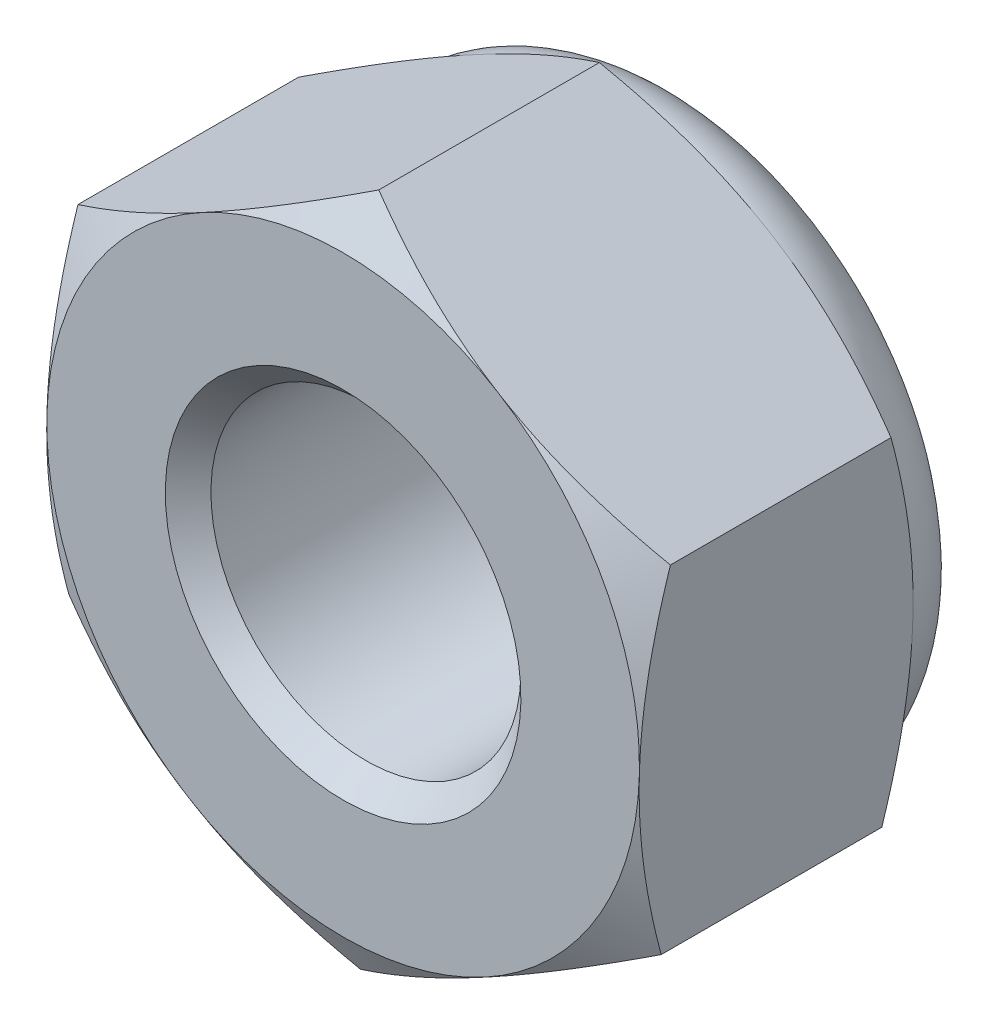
ISO-10303-21;
HEADER;
FILE_DESCRIPTION(('STEP AP214'),'2;1');
FILE_NAME('part.step','',(''),(''),'','','');
FILE_SCHEMA(('AUTOMOTIVE_DESIGN { 1 0 10303 214 1 1 1 1 }'));
ENDSEC;
DATA;
#1=APPLICATION_CONTEXT('core data for automotive mechanical design processes');
#2=APPLICATION_PROTOCOL_DEFINITION('international standard','automotive_design',2000,#1);
#3=PRODUCT_CONTEXT('',#1,'mechanical');
#4=PRODUCT('Part','Part','',(#3));
#5=PRODUCT_RELATED_PRODUCT_CATEGORY('part','',(#4));
#6=PRODUCT_DEFINITION_FORMATION('','',#4);
#7=PRODUCT_DEFINITION_CONTEXT('part definition',#1,'design');
#8=PRODUCT_DEFINITION('design','',#6,#7);
#9=PRODUCT_DEFINITION_SHAPE('','',#8);
#10=(LENGTH_UNIT() NAMED_UNIT(*) SI_UNIT(.MILLI.,.METRE.));
#11=(NAMED_UNIT(*) PLANE_ANGLE_UNIT() SI_UNIT($,.RADIAN.));
#12=(NAMED_UNIT(*) SI_UNIT($,.STERADIAN.) SOLID_ANGLE_UNIT());
#13=UNCERTAINTY_MEASURE_WITH_UNIT(LENGTH_MEASURE(1.E-05),#10,'distance_accuracy_value','');
#14=(GEOMETRIC_REPRESENTATION_CONTEXT(3) GLOBAL_UNCERTAINTY_ASSIGNED_CONTEXT((#13)) GLOBAL_UNIT_ASSIGNED_CONTEXT((#10,
#11,#12)) REPRESENTATION_CONTEXT('',''));
#15=CARTESIAN_POINT('',(0.,0.,0.));
#16=DIRECTION('',(0.,0.,1.));
#17=DIRECTION('',(1.,0.,0.));
#18=AXIS2_PLACEMENT_3D('',#15,#16,#17);
#19=CARTESIAN_POINT('',(826.812757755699,161.353696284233,22.9999999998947));
#20=DIRECTION('',(-0.47652069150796,0.879163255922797,0.));
#21=DIRECTION('',(-0.879163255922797,-0.47652069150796,0.));
#22=AXIS2_PLACEMENT_3D('',#19,#20,#21);
#23=PLANE('',#22);
#24=DIRECTION('',(0.,0.,1.));
#25=VECTOR('',#24,1.);
#26=CARTESIAN_POINT('',(820.214150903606,157.777144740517,22.9999999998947));
#27=LINE('',#26,#25);
#28=CARTESIAN_POINT('',(820.214150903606,157.777144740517,23.5805565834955));
#29=VERTEX_POINT('',#28);
#30=CARTESIAN_POINT('',(820.214150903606,157.777144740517,28.419443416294));
#31=VERTEX_POINT('',#30);
#32=EDGE_CURVE('E175',#29,#31,#27,.T.);
#33=ORIENTED_EDGE('',*,*,#32,.T.);
#34=CARTESIAN_POINT('',(820.213947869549,157.777034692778,28.4193767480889));
#35=CARTESIAN_POINT('',(820.358992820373,157.855651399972,28.4669955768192));
#36=CARTESIAN_POINT('',(820.504578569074,157.934561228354,28.512453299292));
#37=CARTESIAN_POINT('',(820.796932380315,158.093021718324,28.5984513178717));
#38=CARTESIAN_POINT('',(820.943700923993,158.172572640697,28.6389894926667));
#39=CARTESIAN_POINT('',(821.386356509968,158.412499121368,28.7524289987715));
#40=CARTESIAN_POINT('',(821.683990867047,158.573821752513,28.8169521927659));
#41=CARTESIAN_POINT('',(822.12939526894,158.815238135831,28.8926134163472));
#42=CARTESIAN_POINT('',(822.275834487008,158.894610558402,28.9141671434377));
#43=CARTESIAN_POINT('',(822.56937460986,159.053714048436,28.9503096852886));
#44=CARTESIAN_POINT('',(822.716475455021,159.133445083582,28.964899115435));
#45=CARTESIAN_POINT('',(823.010932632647,159.293045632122,28.9867412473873));
#46=CARTESIAN_POINT('',(823.158288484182,159.372914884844,28.9940022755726));
#47=CARTESIAN_POINT('',(823.453128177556,159.532722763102,29.0010396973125));
#48=CARTESIAN_POINT('',(823.6006120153,159.612661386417,29.0008163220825));
#49=CARTESIAN_POINT('',(824.004670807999,159.83166778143,28.9899165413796));
#50=CARTESIAN_POINT('',(824.261113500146,159.970663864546,28.9716181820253));
#51=CARTESIAN_POINT('',(824.772295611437,160.24773282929,28.913593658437));
#52=CARTESIAN_POINT('',(825.027033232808,160.385804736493,28.8738476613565));
#53=CARTESIAN_POINT('',(825.539244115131,160.663431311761,28.7744940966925));
#54=CARTESIAN_POINT('',(825.796652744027,160.802950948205,28.7144655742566));
#55=CARTESIAN_POINT('',(826.307631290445,161.079909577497,28.5782250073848));
#56=CARTESIAN_POINT('',(826.56120775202,161.217352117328,28.5020449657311));
#57=CARTESIAN_POINT('',(826.812960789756,161.353806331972,28.4193767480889));
#58=B_SPLINE_CURVE_WITH_KNOTS('',3,(#34,#35,#36,#37,#38,#39,#40,#41,#42,#43,#44,#45,#46,#47,#48,
#49,#50,#51,#52,#53,#54,#55,#56,#57),.UNSPECIFIED.,.F.,.F.,(4,2,2,2,2,2,2,2,2,2,2,4),(0.,
0.515105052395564,1.03043143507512,2.06322554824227,2.56697389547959,3.07067772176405,
3.57380860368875,4.07692394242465,4.95279354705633,5.82947446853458,6.72559912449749,
7.6199645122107),.UNSPECIFIED.);
#59=CARTESIAN_POINT('',(823.513454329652,159.565420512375,28.9999999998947));
#60=VERTEX_POINT('',#59);
#61=EDGE_CURVE('E39',#31,#60,#58,.T.);
#62=ORIENTED_EDGE('',*,*,#61,.T.);
#63=CARTESIAN_POINT('',(826.812757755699,161.353696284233,28.419443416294));
#64=VERTEX_POINT('',#63);
#65=EDGE_CURVE('E273',#60,#64,#58,.T.);
#66=ORIENTED_EDGE('',*,*,#65,.T.);
#67=DIRECTION('',(0.,0.,1.));
#68=VECTOR('',#67,1.);
#69=CARTESIAN_POINT('',(826.812757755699,161.353696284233,22.9999999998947));
#70=LINE('',#69,#68);
#71=CARTESIAN_POINT('',(826.812757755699,161.353696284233,23.5805565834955));
#72=VERTEX_POINT('',#71);
#73=EDGE_CURVE('E149',#72,#64,#70,.T.);
#74=ORIENTED_EDGE('',*,*,#73,.F.);
#75=CARTESIAN_POINT('',(820.213947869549,157.777034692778,23.5806232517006));
#76=CARTESIAN_POINT('',(820.358992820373,157.855651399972,23.5330044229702));
#77=CARTESIAN_POINT('',(820.504578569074,157.934561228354,23.4875467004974));
#78=CARTESIAN_POINT('',(820.796932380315,158.093021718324,23.4015486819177));
#79=CARTESIAN_POINT('',(820.943700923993,158.172572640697,23.3610105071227));
#80=CARTESIAN_POINT('',(821.386356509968,158.412499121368,23.2475710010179));
#81=CARTESIAN_POINT('',(821.683990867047,158.573821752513,23.1830478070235));
#82=CARTESIAN_POINT('',(822.12939526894,158.815238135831,23.1073865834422));
#83=CARTESIAN_POINT('',(822.275834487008,158.894610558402,23.0858328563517));
#84=CARTESIAN_POINT('',(822.56937460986,159.053714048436,23.0496903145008));
#85=CARTESIAN_POINT('',(822.716475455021,159.133445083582,23.0351008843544));
#86=CARTESIAN_POINT('',(823.010932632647,159.293045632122,23.0132587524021));
#87=CARTESIAN_POINT('',(823.158288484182,159.372914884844,23.0059977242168));
#88=CARTESIAN_POINT('',(823.453128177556,159.532722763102,22.9989603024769));
#89=CARTESIAN_POINT('',(823.6006120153,159.612661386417,22.9991836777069));
#90=CARTESIAN_POINT('',(824.004670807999,159.83166778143,23.0100834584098));
#91=CARTESIAN_POINT('',(824.261113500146,159.970663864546,23.0283818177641));
#92=CARTESIAN_POINT('',(824.772295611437,160.24773282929,23.0864063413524));
#93=CARTESIAN_POINT('',(825.027033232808,160.385804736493,23.1261523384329));
#94=CARTESIAN_POINT('',(825.539244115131,160.663431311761,23.2255059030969));
#95=CARTESIAN_POINT('',(825.796652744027,160.802950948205,23.2855344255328));
#96=CARTESIAN_POINT('',(826.307631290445,161.079909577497,23.4217749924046));
#97=CARTESIAN_POINT('',(826.56120775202,161.217352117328,23.4979550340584));
#98=CARTESIAN_POINT('',(826.812960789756,161.353806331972,23.5806232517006));
#99=B_SPLINE_CURVE_WITH_KNOTS('',3,(#75,#76,#77,#78,#79,#80,#81,#82,#83,#84,#85,#86,#87,#88,#89,
#90,#91,#92,#93,#94,#95,#96,#97,#98),.UNSPECIFIED.,.F.,.F.,(4,2,2,2,2,2,2,2,2,2,2,4),(0.,
0.515105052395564,1.03043143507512,2.06322554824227,2.56697389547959,3.07067772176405,
3.57380860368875,4.07692394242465,4.95279354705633,5.82947446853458,6.72559912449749,
7.61996451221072),.UNSPECIFIED.);
#100=CARTESIAN_POINT('',(823.513454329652,159.565420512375,22.9999999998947));
#101=VERTEX_POINT('',#100);
#102=EDGE_CURVE('E177',#101,#72,#99,.T.);
#103=ORIENTED_EDGE('',*,*,#102,.F.);
#104=EDGE_CURVE('E182',#29,#101,#99,.T.);
#105=ORIENTED_EDGE('',*,*,#104,.F.);
#106=EDGE_LOOP('',(#33,#62,#66,#74,#103,#105));
#107=FACE_BOUND('',#106,.T.);
#108=ADVANCED_FACE('F16',(#107),#23,.T.);
#109=CARTESIAN_POINT('',(833.209445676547,157.427410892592,22.9999999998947));
#110=DIRECTION('',(0.523117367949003,0.85226065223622,0.));
#111=DIRECTION('',(-0.85226065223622,0.523117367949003,0.));
#112=AXIS2_PLACEMENT_3D('',#109,#110,#111);
#113=PLANE('',#112);
#114=ORIENTED_EDGE('',*,*,#73,.T.);
#115=CARTESIAN_POINT('',(826.812560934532,161.353817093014,28.4193767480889));
#116=CARTESIAN_POINT('',(826.953167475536,161.267512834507,28.4669955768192));
#117=CARTESIAN_POINT('',(827.094298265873,161.180886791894,28.512453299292));
#118=CARTESIAN_POINT('',(827.377705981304,161.006931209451,28.5984513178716));
#119=CARTESIAN_POINT('',(827.519983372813,160.919601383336,28.6389894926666));
#120=CARTESIAN_POINT('',(827.949093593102,160.65621364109,28.7524289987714));
#121=CARTESIAN_POINT('',(828.237620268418,160.479116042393,28.8169521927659));
#122=CARTESIAN_POINT('',(828.669395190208,160.214092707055,28.8926134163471));
#123=CARTESIAN_POINT('',(828.811353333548,160.126958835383,28.9141671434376));
#124=CARTESIAN_POINT('',(829.095911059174,159.95229737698,28.9503096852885));
#125=CARTESIAN_POINT('',(829.238510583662,159.864769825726,28.9648991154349));
#126=CARTESIAN_POINT('',(829.523957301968,159.689562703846,28.9867412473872));
#127=CARTESIAN_POINT('',(829.666804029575,159.601883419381,28.9940022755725));
#128=CARTESIAN_POINT('',(829.952621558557,159.426448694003,29.0010396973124));
#129=CARTESIAN_POINT('',(830.095592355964,159.338693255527,29.0008163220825));
#130=CARTESIAN_POINT('',(830.487286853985,159.098271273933,28.9899165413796));
#131=CARTESIAN_POINT('',(830.735882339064,158.945683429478,28.9716181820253));
#132=CARTESIAN_POINT('',(831.231422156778,158.641521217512,28.9135936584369));
#133=CARTESIAN_POINT('',(831.47836474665,158.489947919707,28.8738476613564));
#134=CARTESIAN_POINT('',(831.974901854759,158.185173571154,28.7744940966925));
#135=CARTESIAN_POINT('',(832.224433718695,158.032010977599,28.7144655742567));
#136=CARTESIAN_POINT('',(832.719776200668,157.727969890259,28.5782250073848));
#137=CARTESIAN_POINT('',(832.965593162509,157.577087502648,28.5020449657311));
#138=CARTESIAN_POINT('',(833.209642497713,157.427290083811,28.4193767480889));
#139=B_SPLINE_CURVE_WITH_KNOTS('',3,(#115,#116,#117,#118,#119,#120,#121,#122,#123,#124,#125,
#126,#127,#128,#129,#130,#131,#132,#133,#134,#135,#136,#137,#138),.UNSPECIFIED.,.F.,.F.,(4,2,2,
2,2,2,2,2,2,2,2,4),(0.,0.51510505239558,1.03043143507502,2.06322554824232,2.56697389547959,
3.07067772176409,3.57380860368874,4.07692394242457,4.95279354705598,5.82947446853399,
6.72559912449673,7.61996451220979),.UNSPECIFIED.);
#140=CARTESIAN_POINT('',(830.011101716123,159.390553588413,28.9999999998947));
#141=VERTEX_POINT('',#140);
#142=EDGE_CURVE('E279',#64,#141,#139,.T.);
#143=ORIENTED_EDGE('',*,*,#142,.T.);
#144=CARTESIAN_POINT('',(833.209445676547,157.427410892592,28.419443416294));
#145=VERTEX_POINT('',#144);
#146=EDGE_CURVE('E274',#141,#145,#139,.T.);
#147=ORIENTED_EDGE('',*,*,#146,.T.);
#148=DIRECTION('',(0.,0.,1.));
#149=VECTOR('',#148,1.);
#150=CARTESIAN_POINT('',(833.209445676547,157.427410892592,22.9999999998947));
#151=LINE('',#150,#149);
#152=CARTESIAN_POINT('',(833.209445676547,157.427410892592,23.5805565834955));
#153=VERTEX_POINT('',#152);
#154=EDGE_CURVE('E153',#153,#145,#151,.T.);
#155=ORIENTED_EDGE('',*,*,#154,.F.);
#156=CARTESIAN_POINT('',(826.812560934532,161.353817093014,23.5806232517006));
#157=CARTESIAN_POINT('',(826.953167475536,161.267512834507,23.5330044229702));
#158=CARTESIAN_POINT('',(827.094298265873,161.180886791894,23.4875467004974));
#159=CARTESIAN_POINT('',(827.377705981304,161.006931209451,23.4015486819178));
#160=CARTESIAN_POINT('',(827.519983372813,160.919601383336,23.3610105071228));
#161=CARTESIAN_POINT('',(827.949093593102,160.65621364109,23.247571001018));
#162=CARTESIAN_POINT('',(828.237620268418,160.479116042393,23.1830478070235));
#163=CARTESIAN_POINT('',(828.669395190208,160.214092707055,23.1073865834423));
#164=CARTESIAN_POINT('',(828.811353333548,160.126958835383,23.0858328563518));
#165=CARTESIAN_POINT('',(829.095911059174,159.95229737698,23.0496903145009));
#166=CARTESIAN_POINT('',(829.238510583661,159.864769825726,23.0351008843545));
#167=CARTESIAN_POINT('',(829.523957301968,159.689562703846,23.0132587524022));
#168=CARTESIAN_POINT('',(829.666804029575,159.601883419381,23.0059977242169));
#169=CARTESIAN_POINT('',(829.952621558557,159.426448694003,22.998960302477));
#170=CARTESIAN_POINT('',(830.095592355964,159.338693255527,22.9991836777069));
#171=CARTESIAN_POINT('',(830.487286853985,159.098271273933,23.0100834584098));
#172=CARTESIAN_POINT('',(830.735882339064,158.945683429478,23.0283818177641));
#173=CARTESIAN_POINT('',(831.231422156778,158.641521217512,23.0864063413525));
#174=CARTESIAN_POINT('',(831.47836474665,158.489947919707,23.126152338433));
#175=CARTESIAN_POINT('',(831.974901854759,158.185173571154,23.2255059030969));
#176=CARTESIAN_POINT('',(832.224433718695,158.032010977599,23.2855344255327));
#177=CARTESIAN_POINT('',(832.719776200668,157.727969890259,23.4217749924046));
#178=CARTESIAN_POINT('',(832.965593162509,157.577087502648,23.4979550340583));
#179=CARTESIAN_POINT('',(833.209642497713,157.427290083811,23.5806232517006));
#180=B_SPLINE_CURVE_WITH_KNOTS('',3,(#156,#157,#158,#159,#160,#161,#162,#163,#164,#165,#166,
#167,#168,#169,#170,#171,#172,#173,#174,#175,#176,#177,#178,#179),.UNSPECIFIED.,.F.,.F.,(4,2,2,
2,2,2,2,2,2,2,2,4),(0.,0.515105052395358,1.03043143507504,2.06322554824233,2.56697389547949,
3.07067772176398,3.57380860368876,4.07692394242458,4.95279354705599,5.82947446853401,
6.72559912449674,7.61996451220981),.UNSPECIFIED.);
#181=CARTESIAN_POINT('',(830.011101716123,159.390553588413,22.9999999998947));
#182=VERTEX_POINT('',#181);
#183=EDGE_CURVE('E163',#182,#153,#180,.T.);
#184=ORIENTED_EDGE('',*,*,#183,.F.);
#185=EDGE_CURVE('E181',#72,#182,#180,.T.);
#186=ORIENTED_EDGE('',*,*,#185,.F.);
#187=EDGE_LOOP('',(#114,#143,#147,#155,#184,#186));
#188=FACE_BOUND('',#187,.T.);
#189=ADVANCED_FACE('F280',(#188),#113,.T.);
#190=CARTESIAN_POINT('',(833.209445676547,157.427410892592,22.9999999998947));
#191=DIRECTION('',(-0.999638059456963,0.0269026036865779,0.));
#192=DIRECTION('',(0.,0.,1.));
#193=AXIS2_PLACEMENT_3D('',#190,#191,#192);
#194=PLANE('',#193);
#195=CARTESIAN_POINT('',(832.840726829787,143.726677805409,25.8895764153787));
#196=CARTESIAN_POINT('',(832.848404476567,144.011961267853,26.027491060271));
#197=CARTESIAN_POINT('',(832.856100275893,144.297919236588,26.1640347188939));
#198=CARTESIAN_POINT('',(832.871537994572,144.871548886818,26.4335966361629));
#199=CARTESIAN_POINT('',(832.879279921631,145.159220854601,26.5666142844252));
#200=CARTESIAN_POINT('',(832.894861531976,145.738197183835,26.8290414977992));
#201=CARTESIAN_POINT('',(832.90270152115,146.029512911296,26.9584260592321));
#202=CARTESIAN_POINT('',(832.918445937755,146.614538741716,27.2116377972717));
#203=CARTESIAN_POINT('',(832.926350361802,146.908248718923,27.3354652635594));
#204=CARTESIAN_POINT('',(832.942334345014,147.502176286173,27.5775551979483));
#205=CARTESIAN_POINT('',(832.950414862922,147.802429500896,27.6957306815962));
#206=CARTESIAN_POINT('',(832.96667121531,148.40647767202,27.9228261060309));
#207=CARTESIAN_POINT('',(832.97484706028,148.7102730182,28.0317450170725));
#208=CARTESIAN_POINT('',(832.991290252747,149.321263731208,28.2374009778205));
#209=CARTESIAN_POINT('',(832.999557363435,149.628450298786,28.3341639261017));
#210=CARTESIAN_POINT('',(833.016209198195,150.247193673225,28.5123642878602));
#211=CARTESIAN_POINT('',(833.024593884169,150.558749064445,28.5938065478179));
#212=CARTESIAN_POINT('',(833.041486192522,151.186427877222,28.7374159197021));
#213=CARTESIAN_POINT('',(833.049993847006,151.502552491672,28.799577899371));
#214=CARTESIAN_POINT('',(833.067112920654,152.138657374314,28.9004257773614));
#215=CARTESIAN_POINT('',(833.07572433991,152.458637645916,28.939111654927));
#216=CARTESIAN_POINT('',(833.08865517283,152.939117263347,28.9770534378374));
#217=CARTESIAN_POINT('',(833.092954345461,153.098864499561,28.9863547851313));
#218=CARTESIAN_POINT('',(833.101559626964,153.418616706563,28.9981859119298));
#219=CARTESIAN_POINT('',(833.105865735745,153.578621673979,29.0007157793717));
#220=CARTESIAN_POINT('',(833.114475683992,153.898547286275,28.9989359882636));
#221=CARTESIAN_POINT('',(833.118779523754,154.058467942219,28.9946282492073));
#222=CARTESIAN_POINT('',(833.127378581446,154.377988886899,28.9792824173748));
#223=CARTESIAN_POINT('',(833.131673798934,154.537589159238,28.9682439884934));
#224=CARTESIAN_POINT('',(833.142084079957,154.924410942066,28.9335631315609));
#225=CARTESIAN_POINT('',(833.148191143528,155.1513351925,28.9065481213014));
#226=CARTESIAN_POINT('',(833.160358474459,155.603444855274,28.8404101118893));
#227=CARTESIAN_POINT('',(833.166418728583,155.828629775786,28.801283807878));
#228=CARTESIAN_POINT('',(833.17848743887,156.277074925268,28.7123108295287));
#229=CARTESIAN_POINT('',(833.184495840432,156.500333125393,28.662454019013));
#230=CARTESIAN_POINT('',(833.196450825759,156.944552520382,28.5535412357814));
#231=CARTESIAN_POINT('',(833.202397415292,157.165513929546,28.4944861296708));
#232=CARTESIAN_POINT('',(833.214375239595,157.610581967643,28.3670458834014));
#233=CARTESIAN_POINT('',(833.220404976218,157.83463292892,28.2984675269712));
#234=CARTESIAN_POINT('',(833.232400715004,158.280366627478,28.1545348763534));
#235=CARTESIAN_POINT('',(833.238366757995,158.502050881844,28.0791852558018));
#236=CARTESIAN_POINT('',(833.250211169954,158.942161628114,27.9232664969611));
#237=CARTESIAN_POINT('',(833.256089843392,159.160599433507,27.8427291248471));
#238=CARTESIAN_POINT('',(833.267801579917,159.595780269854,27.6769272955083));
#239=CARTESIAN_POINT('',(833.273634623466,159.812522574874,27.591660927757));
#240=CARTESIAN_POINT('',(833.279446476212,160.028477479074,27.5044978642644));
#241=B_SPLINE_CURVE_WITH_KNOTS('',3,(#195,#196,#197,#198,#199,#200,#201,#202,#203,#204,#205,
#206,#207,#208,#209,#210,#211,#212,#213,#214,#215,#216,#217,#218,#219,#220,#221,#222,#223,#224,
#225,#226,#227,#228,#229,#230,#231,#232,#233,#234,#235,#236,#237,#238,#239,#240),.UNSPECIFIED.,
.F.,.F.,(4,2,2,2,2,2,2,2,2,2,2,2,2,2,2,2,2,2,2,2,2,2,4),(0.,0.9509041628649,1.9019718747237,
2.8584821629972,3.81494253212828,4.78314526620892,5.75145556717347,6.71766655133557,
7.68357137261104,8.64973308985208,9.61589566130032,10.0960003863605,10.5760988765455,
11.056062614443,11.5360503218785,12.221493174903,12.9071232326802,13.5934038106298,
14.2796197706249,14.9826563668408,15.6852113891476,16.3838119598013,17.0826968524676),.UNSPECIFIED.);
#242=CARTESIAN_POINT('',(833.007526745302,149.924573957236,28.419443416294));
#243=VERTEX_POINT('',#242);
#244=CARTESIAN_POINT('',(833.108486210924,153.675992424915,28.9999999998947));
#245=VERTEX_POINT('',#244);
#246=EDGE_CURVE('E263',#243,#245,#241,.T.);
#247=ORIENTED_EDGE('',*,*,#246,.F.);
#248=DIRECTION('',(0.,0.,1.));
#249=VECTOR('',#248,1.);
#250=CARTESIAN_POINT('',(833.007526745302,149.924573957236,22.9999999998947));
#251=LINE('',#250,#249);
#252=CARTESIAN_POINT('',(833.007526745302,149.924573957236,23.5805565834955));
#253=VERTEX_POINT('',#252);
#254=EDGE_CURVE('E160',#253,#243,#251,.T.);
#255=ORIENTED_EDGE('',*,*,#254,.F.);
#256=CARTESIAN_POINT('',(832.840726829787,143.726677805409,26.1104235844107));
#257=CARTESIAN_POINT('',(832.848404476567,144.011961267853,25.9725089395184));
#258=CARTESIAN_POINT('',(832.856100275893,144.297919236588,25.8359652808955));
#259=CARTESIAN_POINT('',(832.871537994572,144.871548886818,25.5664033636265));
#260=CARTESIAN_POINT('',(832.879279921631,145.159220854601,25.4333857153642));
#261=CARTESIAN_POINT('',(832.894861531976,145.738197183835,25.1709585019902));
#262=CARTESIAN_POINT('',(832.90270152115,146.029512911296,25.0415739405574));
#263=CARTESIAN_POINT('',(832.918445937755,146.614538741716,24.7883622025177));
#264=CARTESIAN_POINT('',(832.926350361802,146.908248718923,24.6645347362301));
#265=CARTESIAN_POINT('',(832.942334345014,147.502176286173,24.4224448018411));
#266=CARTESIAN_POINT('',(832.950414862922,147.802429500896,24.3042693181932));
#267=CARTESIAN_POINT('',(832.96667121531,148.40647767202,24.0771738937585));
#268=CARTESIAN_POINT('',(832.97484706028,148.7102730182,23.9682549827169));
#269=CARTESIAN_POINT('',(832.991290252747,149.321263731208,23.7625990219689));
#270=CARTESIAN_POINT('',(832.999557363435,149.628450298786,23.6658360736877));
#271=CARTESIAN_POINT('',(833.016209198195,150.247193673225,23.4876357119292));
#272=CARTESIAN_POINT('',(833.024593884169,150.558749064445,23.4061934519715));
#273=CARTESIAN_POINT('',(833.041486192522,151.186427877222,23.2625840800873));
#274=CARTESIAN_POINT('',(833.049993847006,151.502552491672,23.2004221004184));
#275=CARTESIAN_POINT('',(833.067112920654,152.138657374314,23.099574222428));
#276=CARTESIAN_POINT('',(833.07572433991,152.458637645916,23.0608883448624));
#277=CARTESIAN_POINT('',(833.08865517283,152.939117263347,23.022946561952));
#278=CARTESIAN_POINT('',(833.092954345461,153.098864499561,23.0136452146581));
#279=CARTESIAN_POINT('',(833.101559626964,153.418616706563,23.0018140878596));
#280=CARTESIAN_POINT('',(833.105865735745,153.578621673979,22.9992842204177));
#281=CARTESIAN_POINT('',(833.114475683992,153.898547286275,23.0010640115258));
#282=CARTESIAN_POINT('',(833.118779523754,154.058467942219,23.0053717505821));
#283=CARTESIAN_POINT('',(833.127378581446,154.377988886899,23.0207175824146));
#284=CARTESIAN_POINT('',(833.131673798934,154.537589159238,23.031756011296));
#285=CARTESIAN_POINT('',(833.142084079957,154.924410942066,23.0664368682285));
#286=CARTESIAN_POINT('',(833.148191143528,155.1513351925,23.0934518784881));
#287=CARTESIAN_POINT('',(833.160358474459,155.603444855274,23.1595898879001));
#288=CARTESIAN_POINT('',(833.166418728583,155.828629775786,23.1987161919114));
#289=CARTESIAN_POINT('',(833.17848743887,156.277074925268,23.2876891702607));
#290=CARTESIAN_POINT('',(833.184495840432,156.500333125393,23.3375459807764));
#291=CARTESIAN_POINT('',(833.196450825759,156.944552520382,23.446458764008));
#292=CARTESIAN_POINT('',(833.202397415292,157.165513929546,23.5055138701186));
#293=CARTESIAN_POINT('',(833.214375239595,157.610581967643,23.632954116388));
#294=CARTESIAN_POINT('',(833.220404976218,157.83463292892,23.7015324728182));
#295=CARTESIAN_POINT('',(833.232400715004,158.280366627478,23.845465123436));
#296=CARTESIAN_POINT('',(833.238366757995,158.502050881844,23.9208147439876));
#297=CARTESIAN_POINT('',(833.250211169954,158.942161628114,24.0767335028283));
#298=CARTESIAN_POINT('',(833.256089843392,159.160599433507,24.1572708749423));
#299=CARTESIAN_POINT('',(833.267801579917,159.595780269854,24.3230727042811));
#300=CARTESIAN_POINT('',(833.273634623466,159.812522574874,24.4083390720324));
#301=CARTESIAN_POINT('',(833.279446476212,160.028477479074,24.495502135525));
#302=B_SPLINE_CURVE_WITH_KNOTS('',3,(#256,#257,#258,#259,#260,#261,#262,#263,#264,#265,#266,
#267,#268,#269,#270,#271,#272,#273,#274,#275,#276,#277,#278,#279,#280,#281,#282,#283,#284,#285,
#286,#287,#288,#289,#290,#291,#292,#293,#294,#295,#296,#297,#298,#299,#300,#301),.UNSPECIFIED.,
.F.,.F.,(4,2,2,2,2,2,2,2,2,2,2,2,2,2,2,2,2,2,2,2,2,2,4),(0.,0.950904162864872,1.90197187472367,
2.85848216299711,3.81494253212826,4.78314526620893,5.75145556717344,6.71766655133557,
7.68357137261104,8.64973308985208,9.61589566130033,10.0960003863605,10.5760988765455,
11.056062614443,11.5360503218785,12.2214931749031,12.9071232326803,13.5934038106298,
14.2796197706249,14.9826563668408,15.6852113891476,16.3838119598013,17.0826968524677),.UNSPECIFIED.);
#303=CARTESIAN_POINT('',(833.108486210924,153.675992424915,22.9999999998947));
#304=VERTEX_POINT('',#303);
#305=EDGE_CURVE('E134',#253,#304,#302,.T.);
#306=ORIENTED_EDGE('',*,*,#305,.T.);
#307=EDGE_CURVE('E189',#304,#153,#302,.T.);
#308=ORIENTED_EDGE('',*,*,#307,.T.);
#309=ORIENTED_EDGE('',*,*,#154,.T.);
#310=EDGE_CURVE('E268',#245,#145,#241,.T.);
#311=ORIENTED_EDGE('',*,*,#310,.F.);
#312=EDGE_LOOP('',(#247,#255,#306,#308,#309,#311));
#313=FACE_BOUND('',#312,.T.);
#314=ADVANCED_FACE('F202',(#313),#194,.F.);
#315=CARTESIAN_POINT('',(826.408919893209,146.348022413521,22.9999999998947));
#316=DIRECTION('',(0.47652069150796,-0.879163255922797,0.));
#317=DIRECTION('',(0.879163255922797,0.47652069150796,0.));
#318=AXIS2_PLACEMENT_3D('',#315,#316,#317);
#319=PLANE('',#318);
#320=ORIENTED_EDGE('',*,*,#254,.T.);
#321=CARTESIAN_POINT('',(833.007729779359,149.924684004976,28.4193767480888));
#322=CARTESIAN_POINT('',(832.862684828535,149.846067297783,28.4669955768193));
#323=CARTESIAN_POINT('',(832.717099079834,149.767157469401,28.5124532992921));
#324=CARTESIAN_POINT('',(832.424745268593,149.60869697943,28.5984513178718));
#325=CARTESIAN_POINT('',(832.277976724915,149.529146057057,28.6389894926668));
#326=CARTESIAN_POINT('',(831.835321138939,149.289219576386,28.7524289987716));
#327=CARTESIAN_POINT('',(831.537686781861,149.127896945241,28.8169521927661));
#328=CARTESIAN_POINT('',(831.092282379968,148.886480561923,28.8926134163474));
#329=CARTESIAN_POINT('',(830.945843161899,148.807108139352,28.9141671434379));
#330=CARTESIAN_POINT('',(830.652303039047,148.648004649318,28.9503096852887));
#331=CARTESIAN_POINT('',(830.505202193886,148.568273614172,28.9648991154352));
#332=CARTESIAN_POINT('',(830.210745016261,148.408673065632,28.9867412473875));
#333=CARTESIAN_POINT('',(830.063389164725,148.328803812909,28.9940022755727));
#334=CARTESIAN_POINT('',(829.768549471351,148.168995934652,29.0010396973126));
#335=CARTESIAN_POINT('',(829.621065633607,148.089057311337,29.0008163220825));
#336=CARTESIAN_POINT('',(829.217006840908,147.870050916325,28.9899165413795));
#337=CARTESIAN_POINT('',(828.960564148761,147.731054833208,28.9716181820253));
#338=CARTESIAN_POINT('',(828.44938203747,147.453985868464,28.9135936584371));
#339=CARTESIAN_POINT('',(828.1946444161,147.315913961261,28.8738476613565));
#340=CARTESIAN_POINT('',(827.682433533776,147.038287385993,28.7744940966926));
#341=CARTESIAN_POINT('',(827.42502490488,146.898767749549,28.7144655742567));
#342=CARTESIAN_POINT('',(826.914046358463,146.621809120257,28.5782250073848));
#343=CARTESIAN_POINT('',(826.660469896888,146.484366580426,28.5020449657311));
#344=CARTESIAN_POINT('',(826.408716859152,146.347912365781,28.4193767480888));
#345=B_SPLINE_CURVE_WITH_KNOTS('',3,(#321,#322,#323,#324,#325,#326,#327,#328,#329,#330,#331,
#332,#333,#334,#335,#336,#337,#338,#339,#340,#341,#342,#343,#344),.UNSPECIFIED.,.F.,.F.,(4,2,2,
2,2,2,2,2,2,2,2,4),(0.,0.515105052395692,1.0304314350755,2.06322554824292,2.56697389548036,
3.07067772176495,3.57380860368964,4.0769239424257,4.95279354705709,5.82947446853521,
6.72559912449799,7.61996451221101),.UNSPECIFIED.);
#346=CARTESIAN_POINT('',(829.708223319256,148.136298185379,28.9999999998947));
#347=VERTEX_POINT('',#346);
#348=EDGE_CURVE('E262',#243,#347,#345,.T.);
#349=ORIENTED_EDGE('',*,*,#348,.T.);
#350=CARTESIAN_POINT('',(826.408919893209,146.348022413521,28.419443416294));
#351=VERTEX_POINT('',#350);
#352=EDGE_CURVE('E257',#347,#351,#345,.T.);
#353=ORIENTED_EDGE('',*,*,#352,.T.);
#354=DIRECTION('',(0.,0.,1.));
#355=VECTOR('',#354,1.);
#356=CARTESIAN_POINT('',(826.408919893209,146.348022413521,22.9999999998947));
#357=LINE('',#356,#355);
#358=CARTESIAN_POINT('',(826.408919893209,146.348022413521,23.5805565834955));
#359=VERTEX_POINT('',#358);
#360=EDGE_CURVE('E115',#359,#351,#357,.T.);
#361=ORIENTED_EDGE('',*,*,#360,.F.);
#362=CARTESIAN_POINT('',(833.007729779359,149.924684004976,23.5806232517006));
#363=CARTESIAN_POINT('',(832.862684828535,149.846067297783,23.5330044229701));
#364=CARTESIAN_POINT('',(832.717099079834,149.767157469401,23.4875467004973));
#365=CARTESIAN_POINT('',(832.424745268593,149.60869697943,23.4015486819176));
#366=CARTESIAN_POINT('',(832.277976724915,149.529146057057,23.3610105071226));
#367=CARTESIAN_POINT('',(831.835321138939,149.289219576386,23.2475710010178));
#368=CARTESIAN_POINT('',(831.537686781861,149.127896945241,23.1830478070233));
#369=CARTESIAN_POINT('',(831.092282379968,148.886480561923,23.107386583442));
#370=CARTESIAN_POINT('',(830.945843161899,148.807108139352,23.0858328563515));
#371=CARTESIAN_POINT('',(830.652303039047,148.648004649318,23.0496903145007));
#372=CARTESIAN_POINT('',(830.505202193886,148.568273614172,23.0351008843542));
#373=CARTESIAN_POINT('',(830.210745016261,148.408673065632,23.0132587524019));
#374=CARTESIAN_POINT('',(830.063389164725,148.328803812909,23.0059977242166));
#375=CARTESIAN_POINT('',(829.768549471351,148.168995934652,22.9989603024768));
#376=CARTESIAN_POINT('',(829.621065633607,148.089057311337,22.9991836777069));
#377=CARTESIAN_POINT('',(829.217006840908,147.870050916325,23.0100834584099));
#378=CARTESIAN_POINT('',(828.960564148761,147.731054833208,23.0283818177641));
#379=CARTESIAN_POINT('',(828.44938203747,147.453985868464,23.0864063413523));
#380=CARTESIAN_POINT('',(828.1946444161,147.315913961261,23.1261523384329));
#381=CARTESIAN_POINT('',(827.682433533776,147.038287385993,23.2255059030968));
#382=CARTESIAN_POINT('',(827.42502490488,146.898767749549,23.2855344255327));
#383=CARTESIAN_POINT('',(826.914046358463,146.621809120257,23.4217749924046));
#384=CARTESIAN_POINT('',(826.660469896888,146.484366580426,23.4979550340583));
#385=CARTESIAN_POINT('',(826.408716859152,146.347912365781,23.5806232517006));
#386=B_SPLINE_CURVE_WITH_KNOTS('',3,(#362,#363,#364,#365,#366,#367,#368,#369,#370,#371,#372,
#373,#374,#375,#376,#377,#378,#379,#380,#381,#382,#383,#384,#385),.UNSPECIFIED.,.F.,.F.,(4,2,2,
2,2,2,2,2,2,2,2,4),(0.,0.515105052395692,1.0304314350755,2.06322554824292,2.56697389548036,
3.07067772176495,3.57380860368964,4.0769239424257,4.95279354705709,5.82947446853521,
6.72559912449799,7.61996451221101),.UNSPECIFIED.);
#387=CARTESIAN_POINT('',(829.708223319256,148.136298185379,22.9999999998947));
#388=VERTEX_POINT('',#387);
#389=EDGE_CURVE('E106',#388,#359,#386,.T.);
#390=ORIENTED_EDGE('',*,*,#389,.F.);
#391=EDGE_CURVE('E111',#253,#388,#386,.T.);
#392=ORIENTED_EDGE('',*,*,#391,.F.);
#393=EDGE_LOOP('',(#320,#349,#353,#361,#390,#392));
#394=FACE_BOUND('',#393,.T.);
#395=ADVANCED_FACE('F109',(#394),#319,.T.);
#396=CARTESIAN_POINT('',(820.012231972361,150.274307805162,22.9999999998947));
#397=DIRECTION('',(-0.523117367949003,-0.85226065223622,0.));
#398=DIRECTION('',(0.85226065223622,-0.523117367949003,0.));
#399=AXIS2_PLACEMENT_3D('',#396,#397,#398);
#400=PLANE('',#399);
#401=ORIENTED_EDGE('',*,*,#360,.T.);
#402=CARTESIAN_POINT('',(826.409116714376,146.34790160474,28.4193767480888));
#403=CARTESIAN_POINT('',(826.268510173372,146.434205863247,28.4669955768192));
#404=CARTESIAN_POINT('',(826.127379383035,146.52083190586,28.5124532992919));
#405=CARTESIAN_POINT('',(825.843971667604,146.694787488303,28.5984513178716));
#406=CARTESIAN_POINT('',(825.701694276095,146.782117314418,28.6389894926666));
#407=CARTESIAN_POINT('',(825.272584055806,147.045505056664,28.7524289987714));
#408=CARTESIAN_POINT('',(824.98405738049,147.222602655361,28.8169521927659));
#409=CARTESIAN_POINT('',(824.5522824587,147.487625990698,28.8926134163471));
#410=CARTESIAN_POINT('',(824.41032431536,147.574759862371,28.9141671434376));
#411=CARTESIAN_POINT('',(824.125766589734,147.749421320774,28.9503096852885));
#412=CARTESIAN_POINT('',(823.983167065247,147.836948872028,28.9648991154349));
#413=CARTESIAN_POINT('',(823.69772034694,148.012155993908,28.9867412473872));
#414=CARTESIAN_POINT('',(823.554873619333,148.099835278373,28.9940022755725));
#415=CARTESIAN_POINT('',(823.269056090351,148.275270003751,29.0010396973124));
#416=CARTESIAN_POINT('',(823.126085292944,148.363025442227,29.0008163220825));
#417=CARTESIAN_POINT('',(822.734390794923,148.603447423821,28.9899165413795));
#418=CARTESIAN_POINT('',(822.485795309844,148.756035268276,28.9716181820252));
#419=CARTESIAN_POINT('',(821.99025549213,149.060197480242,28.9135936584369));
#420=CARTESIAN_POINT('',(821.743312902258,149.211770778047,28.8738476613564));
#421=CARTESIAN_POINT('',(821.246775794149,149.5165451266,28.7744940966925));
#422=CARTESIAN_POINT('',(820.997243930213,149.669707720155,28.7144655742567));
#423=CARTESIAN_POINT('',(820.50190144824,149.973748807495,28.5782250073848));
#424=CARTESIAN_POINT('',(820.256084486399,150.124631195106,28.5020449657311));
#425=CARTESIAN_POINT('',(820.012035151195,150.274428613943,28.4193767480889));
#426=B_SPLINE_CURVE_WITH_KNOTS('',3,(#402,#403,#404,#405,#406,#407,#408,#409,#410,#411,#412,
#413,#414,#415,#416,#417,#418,#419,#420,#421,#422,#423,#424,#425),.UNSPECIFIED.,.F.,.F.,(4,2,2,
2,2,2,2,2,2,2,2,4),(0.,0.515105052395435,1.03043143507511,2.06322554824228,2.56697389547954,
3.07067772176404,3.57380860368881,4.07692394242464,4.95279354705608,5.8294744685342,
6.72559912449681,7.6199645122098),.UNSPECIFIED.);
#427=CARTESIAN_POINT('',(823.210575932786,148.311165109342,28.9999999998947));
#428=VERTEX_POINT('',#427);
#429=EDGE_CURVE('E250',#351,#428,#426,.T.);
#430=ORIENTED_EDGE('',*,*,#429,.T.);
#431=CARTESIAN_POINT('',(820.012231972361,150.274307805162,28.419443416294));
#432=VERTEX_POINT('',#431);
#433=EDGE_CURVE('E243',#428,#432,#426,.T.);
#434=ORIENTED_EDGE('',*,*,#433,.T.);
#435=DIRECTION('',(0.,0.,1.));
#436=VECTOR('',#435,1.);
#437=CARTESIAN_POINT('',(820.012231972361,150.274307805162,22.9999999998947));
#438=LINE('',#437,#436);
#439=CARTESIAN_POINT('',(820.012231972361,150.274307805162,23.5805565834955));
#440=VERTEX_POINT('',#439);
#441=EDGE_CURVE('E173',#440,#432,#438,.T.);
#442=ORIENTED_EDGE('',*,*,#441,.F.);
#443=CARTESIAN_POINT('',(826.409116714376,146.34790160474,23.5806232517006));
#444=CARTESIAN_POINT('',(826.268510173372,146.434205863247,23.5330044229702));
#445=CARTESIAN_POINT('',(826.127379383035,146.52083190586,23.4875467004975));
#446=CARTESIAN_POINT('',(825.843971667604,146.694787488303,23.4015486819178));
#447=CARTESIAN_POINT('',(825.701694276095,146.782117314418,23.3610105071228));
#448=CARTESIAN_POINT('',(825.272584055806,147.045505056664,23.247571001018));
#449=CARTESIAN_POINT('',(824.98405738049,147.222602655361,23.1830478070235));
#450=CARTESIAN_POINT('',(824.5522824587,147.487625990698,23.1073865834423));
#451=CARTESIAN_POINT('',(824.41032431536,147.574759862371,23.0858328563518));
#452=CARTESIAN_POINT('',(824.125766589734,147.749421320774,23.0496903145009));
#453=CARTESIAN_POINT('',(823.983167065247,147.836948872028,23.0351008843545));
#454=CARTESIAN_POINT('',(823.69772034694,148.012155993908,23.0132587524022));
#455=CARTESIAN_POINT('',(823.554873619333,148.099835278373,23.0059977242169));
#456=CARTESIAN_POINT('',(823.269056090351,148.275270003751,22.998960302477));
#457=CARTESIAN_POINT('',(823.126085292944,148.363025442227,22.9991836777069));
#458=CARTESIAN_POINT('',(822.734390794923,148.603447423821,23.0100834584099));
#459=CARTESIAN_POINT('',(822.485795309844,148.756035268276,23.0283818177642));
#460=CARTESIAN_POINT('',(821.99025549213,149.060197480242,23.0864063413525));
#461=CARTESIAN_POINT('',(821.743312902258,149.211770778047,23.126152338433));
#462=CARTESIAN_POINT('',(821.246775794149,149.5165451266,23.2255059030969));
#463=CARTESIAN_POINT('',(820.997243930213,149.669707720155,23.2855344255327));
#464=CARTESIAN_POINT('',(820.50190144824,149.973748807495,23.4217749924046));
#465=CARTESIAN_POINT('',(820.256084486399,150.124631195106,23.4979550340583));
#466=CARTESIAN_POINT('',(820.012035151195,150.274428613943,23.5806232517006));
#467=B_SPLINE_CURVE_WITH_KNOTS('',3,(#443,#444,#445,#446,#447,#448,#449,#450,#451,#452,#453,
#454,#455,#456,#457,#458,#459,#460,#461,#462,#463,#464,#465,#466),.UNSPECIFIED.,.F.,.F.,(4,2,2,
2,2,2,2,2,2,2,2,4),(0.,0.515105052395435,1.03043143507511,2.06322554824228,2.56697389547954,
3.07067772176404,3.57380860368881,4.07692394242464,4.95279354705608,5.8294744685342,
6.72559912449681,7.61996451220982),.UNSPECIFIED.);
#468=CARTESIAN_POINT('',(823.210575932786,148.311165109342,22.9999999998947));
#469=VERTEX_POINT('',#468);
#470=EDGE_CURVE('E227',#469,#440,#467,.T.);
#471=ORIENTED_EDGE('',*,*,#470,.F.);
#472=EDGE_CURVE('E119',#359,#469,#467,.T.);
#473=ORIENTED_EDGE('',*,*,#472,.F.);
#474=EDGE_LOOP('',(#401,#430,#434,#442,#471,#473));
#475=FACE_BOUND('',#474,.T.);
#476=ADVANCED_FACE('F234',(#475),#400,.T.);
#477=CARTESIAN_POINT('',(820.214150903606,157.777144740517,22.9999999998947));
#478=DIRECTION('',(-0.999638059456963,0.0269026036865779,0.));
#479=DIRECTION('',(0.,0.,1.));
#480=AXIS2_PLACEMENT_3D('',#477,#478,#479);
#481=PLANE('',#480);
#482=ORIENTED_EDGE('',*,*,#441,.T.);
#483=CARTESIAN_POINT('',(819.845432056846,144.076411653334,25.8895764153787));
#484=CARTESIAN_POINT('',(819.853109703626,144.361695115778,26.0274910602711));
#485=CARTESIAN_POINT('',(819.860805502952,144.647653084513,26.164034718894));
#486=CARTESIAN_POINT('',(819.876243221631,145.221282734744,26.4335966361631));
#487=CARTESIAN_POINT('',(819.88398514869,145.508954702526,26.5666142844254));
#488=CARTESIAN_POINT('',(819.899566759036,146.087931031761,26.8290414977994));
#489=CARTESIAN_POINT('',(819.907406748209,146.379246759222,26.9584260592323));
#490=CARTESIAN_POINT('',(819.923151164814,146.964272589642,27.2116377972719));
#491=CARTESIAN_POINT('',(819.931055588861,147.257982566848,27.3354652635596));
#492=CARTESIAN_POINT('',(819.947039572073,147.851910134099,27.5775551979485));
#493=CARTESIAN_POINT('',(819.955120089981,148.152163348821,27.6957306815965));
#494=CARTESIAN_POINT('',(819.97137644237,148.756211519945,27.9228261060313));
#495=CARTESIAN_POINT('',(819.979552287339,149.060006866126,28.0317450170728));
#496=CARTESIAN_POINT('',(819.995995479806,149.670997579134,28.2374009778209));
#497=CARTESIAN_POINT('',(820.004262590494,149.978184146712,28.3341639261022));
#498=CARTESIAN_POINT('',(820.020914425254,150.596927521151,28.5123642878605));
#499=CARTESIAN_POINT('',(820.029299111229,150.908482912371,28.5938065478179));
#500=CARTESIAN_POINT('',(820.046191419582,151.536161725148,28.7374159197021));
#501=CARTESIAN_POINT('',(820.054699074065,151.852286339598,28.7995778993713));
#502=CARTESIAN_POINT('',(820.071818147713,152.48839122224,28.9004257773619));
#503=CARTESIAN_POINT('',(820.080429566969,152.808371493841,28.9391116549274));
#504=CARTESIAN_POINT('',(820.093360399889,153.288851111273,28.9770534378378));
#505=CARTESIAN_POINT('',(820.09765957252,153.448598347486,28.9863547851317));
#506=CARTESIAN_POINT('',(820.106264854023,153.768350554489,28.9981859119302));
#507=CARTESIAN_POINT('',(820.110570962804,153.928355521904,29.000715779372));
#508=CARTESIAN_POINT('',(820.119180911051,154.248281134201,28.9989359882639));
#509=CARTESIAN_POINT('',(820.123484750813,154.408201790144,28.9946282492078));
#510=CARTESIAN_POINT('',(820.132083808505,154.727722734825,28.9792824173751));
#511=CARTESIAN_POINT('',(820.136379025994,154.887323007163,28.9682439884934));
#512=CARTESIAN_POINT('',(820.146789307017,155.274144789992,28.9335631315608));
#513=CARTESIAN_POINT('',(820.152896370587,155.501069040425,28.9065481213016));
#514=CARTESIAN_POINT('',(820.165063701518,155.9531787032,28.8404101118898));
#515=CARTESIAN_POINT('',(820.171123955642,156.178363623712,28.8012838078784));
#516=CARTESIAN_POINT('',(820.183192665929,156.626808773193,28.712310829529));
#517=CARTESIAN_POINT('',(820.189201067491,156.850066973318,28.6624540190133));
#518=CARTESIAN_POINT('',(820.201156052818,157.294286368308,28.5535412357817));
#519=CARTESIAN_POINT('',(820.207102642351,157.515247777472,28.4944861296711));
#520=CARTESIAN_POINT('',(820.219080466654,157.960315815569,28.3670458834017));
#521=CARTESIAN_POINT('',(820.225110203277,158.184366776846,28.2984675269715));
#522=CARTESIAN_POINT('',(820.237105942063,158.630100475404,28.1545348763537));
#523=CARTESIAN_POINT('',(820.243071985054,158.851784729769,28.079185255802));
#524=CARTESIAN_POINT('',(820.254916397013,159.29189547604,27.9232664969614));
#525=CARTESIAN_POINT('',(820.260795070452,159.510333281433,27.8427291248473));
#526=CARTESIAN_POINT('',(820.272506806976,159.94551411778,27.6769272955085));
#527=CARTESIAN_POINT('',(820.278339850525,160.1622564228,27.5916609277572));
#528=CARTESIAN_POINT('',(820.284151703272,160.378211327,27.5044978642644));
#529=B_SPLINE_CURVE_WITH_KNOTS('',3,(#483,#484,#485,#486,#487,#488,#489,#490,#491,#492,#493,
#494,#495,#496,#497,#498,#499,#500,#501,#502,#503,#504,#505,#506,#507,#508,#509,#510,#511,#512,
#513,#514,#515,#516,#517,#518,#519,#520,#521,#522,#523,#524,#525,#526,#527,#528),.UNSPECIFIED.,
.F.,.F.,(4,2,2,2,2,2,2,2,2,2,2,2,2,2,2,2,2,2,2,2,2,2,4),(0.,0.950904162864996,1.90197187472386,
2.8584821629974,3.81494253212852,4.78314526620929,5.75145556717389,6.71766655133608,
7.68357137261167,8.64973308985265,9.61589566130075,10.0960003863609,10.5760988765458,
11.0560626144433,11.5360503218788,12.2214931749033,12.9071232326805,13.5934038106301,
14.2796197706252,14.9826563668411,15.6852113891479,16.3838119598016,17.082696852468),.UNSPECIFIED.);
#530=CARTESIAN_POINT('',(820.113191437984,154.02572627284,28.9999999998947));
#531=VERTEX_POINT('',#530);
#532=EDGE_CURVE('E251',#432,#531,#529,.T.);
#533=ORIENTED_EDGE('',*,*,#532,.T.);
#534=EDGE_CURVE('E252',#531,#31,#529,.T.);
#535=ORIENTED_EDGE('',*,*,#534,.T.);
#536=ORIENTED_EDGE('',*,*,#32,.F.);
#537=CARTESIAN_POINT('',(819.845432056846,144.076411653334,26.1104235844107));
#538=CARTESIAN_POINT('',(819.853109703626,144.361695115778,25.9725089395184));
#539=CARTESIAN_POINT('',(819.860805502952,144.647653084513,25.8359652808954));
#540=CARTESIAN_POINT('',(819.876243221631,145.221282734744,25.5664033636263));
#541=CARTESIAN_POINT('',(819.88398514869,145.508954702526,25.433385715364));
#542=CARTESIAN_POINT('',(819.899566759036,146.087931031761,25.17095850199));
#543=CARTESIAN_POINT('',(819.907406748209,146.379246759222,25.0415739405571));
#544=CARTESIAN_POINT('',(819.923151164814,146.964272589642,24.7883622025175));
#545=CARTESIAN_POINT('',(819.931055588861,147.257982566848,24.6645347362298));
#546=CARTESIAN_POINT('',(819.947039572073,147.851910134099,24.4224448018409));
#547=CARTESIAN_POINT('',(819.955120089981,148.152163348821,24.3042693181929));
#548=CARTESIAN_POINT('',(819.97137644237,148.756211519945,24.0771738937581));
#549=CARTESIAN_POINT('',(819.979552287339,149.060006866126,23.9682549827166));
#550=CARTESIAN_POINT('',(819.995995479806,149.670997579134,23.7625990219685));
#551=CARTESIAN_POINT('',(820.004262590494,149.978184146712,23.6658360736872));
#552=CARTESIAN_POINT('',(820.020914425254,150.596927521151,23.4876357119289));
#553=CARTESIAN_POINT('',(820.029299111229,150.908482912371,23.4061934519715));
#554=CARTESIAN_POINT('',(820.046191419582,151.536161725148,23.2625840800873));
#555=CARTESIAN_POINT('',(820.054699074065,151.852286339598,23.2004221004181));
#556=CARTESIAN_POINT('',(820.071818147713,152.48839122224,23.0995742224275));
#557=CARTESIAN_POINT('',(820.080429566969,152.808371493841,23.060888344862));
#558=CARTESIAN_POINT('',(820.093360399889,153.288851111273,23.0229465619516));
#559=CARTESIAN_POINT('',(820.09765957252,153.448598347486,23.0136452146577));
#560=CARTESIAN_POINT('',(820.106264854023,153.768350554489,23.0018140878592));
#561=CARTESIAN_POINT('',(820.110570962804,153.928355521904,22.9992842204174));
#562=CARTESIAN_POINT('',(820.119180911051,154.248281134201,23.0010640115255));
#563=CARTESIAN_POINT('',(820.123484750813,154.408201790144,23.0053717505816));
#564=CARTESIAN_POINT('',(820.132083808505,154.727722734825,23.0207175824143));
#565=CARTESIAN_POINT('',(820.136379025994,154.887323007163,23.031756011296));
#566=CARTESIAN_POINT('',(820.146789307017,155.274144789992,23.0664368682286));
#567=CARTESIAN_POINT('',(820.152896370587,155.501069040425,23.0934518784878));
#568=CARTESIAN_POINT('',(820.165063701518,155.9531787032,23.1595898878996));
#569=CARTESIAN_POINT('',(820.171123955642,156.178363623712,23.198716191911));
#570=CARTESIAN_POINT('',(820.183192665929,156.626808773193,23.2876891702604));
#571=CARTESIAN_POINT('',(820.189201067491,156.850066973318,23.3375459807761));
#572=CARTESIAN_POINT('',(820.201156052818,157.294286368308,23.4464587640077));
#573=CARTESIAN_POINT('',(820.207102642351,157.515247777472,23.5055138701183));
#574=CARTESIAN_POINT('',(820.219080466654,157.960315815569,23.6329541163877));
#575=CARTESIAN_POINT('',(820.225110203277,158.184366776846,23.7015324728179));
#576=CARTESIAN_POINT('',(820.237105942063,158.630100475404,23.8454651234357));
#577=CARTESIAN_POINT('',(820.243071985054,158.851784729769,23.9208147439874));
#578=CARTESIAN_POINT('',(820.254916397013,159.29189547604,24.0767335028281));
#579=CARTESIAN_POINT('',(820.260795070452,159.510333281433,24.1572708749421));
#580=CARTESIAN_POINT('',(820.272506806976,159.94551411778,24.3230727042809));
#581=CARTESIAN_POINT('',(820.278339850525,160.1622564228,24.4083390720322));
#582=CARTESIAN_POINT('',(820.284151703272,160.378211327,24.495502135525));
#583=B_SPLINE_CURVE_WITH_KNOTS('',3,(#537,#538,#539,#540,#541,#542,#543,#544,#545,#546,#547,
#548,#549,#550,#551,#552,#553,#554,#555,#556,#557,#558,#559,#560,#561,#562,#563,#564,#565,#566,
#567,#568,#569,#570,#571,#572,#573,#574,#575,#576,#577,#578,#579,#580,#581,#582),.UNSPECIFIED.,
.F.,.F.,(4,2,2,2,2,2,2,2,2,2,2,2,2,2,2,2,2,2,2,2,2,2,4),(0.,0.950904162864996,1.90197187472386,
2.8584821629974,3.81494253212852,4.78314526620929,5.75145556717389,6.71766655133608,
7.68357137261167,8.64973308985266,9.61589566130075,10.0960003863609,10.5760988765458,
11.0560626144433,11.5360503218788,12.2214931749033,12.9071232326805,13.5934038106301,
14.2796197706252,14.9826563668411,15.6852113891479,16.3838119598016,17.082696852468),.UNSPECIFIED.);
#584=CARTESIAN_POINT('',(820.113191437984,154.02572627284,22.9999999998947));
#585=VERTEX_POINT('',#584);
#586=EDGE_CURVE('E220',#585,#29,#583,.T.);
#587=ORIENTED_EDGE('',*,*,#586,.F.);
#588=EDGE_CURVE('E233',#440,#585,#583,.T.);
#589=ORIENTED_EDGE('',*,*,#588,.F.);
#590=EDGE_LOOP('',(#482,#533,#535,#536,#587,#589));
#591=FACE_BOUND('',#590,.T.);
#592=ADVANCED_FACE('F237',(#591),#481,.T.);
#593=CARTESIAN_POINT('',(813.615544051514,154.200593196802,28.9999999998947));
#594=DIRECTION('',(0.,0.,1.));
#595=DIRECTION('',(0.999638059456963,-0.0269026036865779,0.));
#596=AXIS2_PLACEMENT_3D('',#593,#594,#595);
#597=PLANE('',#596);
#598=CARTESIAN_POINT('',(826.610838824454,153.850859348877,28.9999999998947));
#599=DIRECTION('',(0.,0.,1.));
#600=DIRECTION('',(0.999638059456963,-0.0269026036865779,0.));
#601=AXIS2_PLACEMENT_3D('',#598,#599,#600);
#602=CIRCLE('',#601,3.9);
#603=CARTESIAN_POINT('',(830.509427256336,153.745939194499,28.9999999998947));
#604=VERTEX_POINT('',#603);
#605=EDGE_CURVE('E24',#604,#604,#602,.F.);
#606=ORIENTED_EDGE('',*,*,#605,.T.);
#607=EDGE_LOOP('',(#606));
#608=FACE_BOUND('',#607,.T.);
#609=CARTESIAN_POINT('',(826.610838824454,153.850859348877,28.9999999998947));
#610=DIRECTION('',(0.,0.,1.));
#611=DIRECTION('',(0.999638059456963,-0.0269026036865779,0.));
#612=AXIS2_PLACEMENT_3D('',#609,#610,#611);
#613=CIRCLE('',#612,6.5);
#614=EDGE_CURVE('E141',#347,#245,#613,.T.);
#615=ORIENTED_EDGE('',*,*,#614,.T.);
#616=CARTESIAN_POINT('',(826.610838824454,153.850859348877,28.9999999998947));
#617=DIRECTION('',(0.,0.,1.));
#618=DIRECTION('',(0.999638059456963,-0.0269026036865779,0.));
#619=AXIS2_PLACEMENT_3D('',#616,#617,#618);
#620=CIRCLE('',#619,6.5);
#621=EDGE_CURVE('E31',#245,#141,#620,.T.);
#622=ORIENTED_EDGE('',*,*,#621,.T.);
#623=EDGE_CURVE('E146',#141,#60,#613,.T.);
#624=ORIENTED_EDGE('',*,*,#623,.T.);
#625=EDGE_CURVE('E497',#60,#531,#613,.T.);
#626=ORIENTED_EDGE('',*,*,#625,.T.);
#627=EDGE_CURVE('E500',#531,#428,#613,.T.);
#628=ORIENTED_EDGE('',*,*,#627,.T.);
#629=EDGE_CURVE('E144',#428,#347,#613,.T.);
#630=ORIENTED_EDGE('',*,*,#629,.T.);
#631=EDGE_LOOP('',(#615,#622,#624,#626,#628,#630));
#632=FACE_BOUND('',#631,.T.);
#633=ADVANCED_FACE('F283',(#608,#632),#597,.T.);
#634=CARTESIAN_POINT('',(826.610838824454,153.850859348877,22.9999999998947));
#635=DIRECTION('',(0.,0.,1.));
#636=DIRECTION('',(0.999638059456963,-0.0269026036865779,0.));
#637=AXIS2_PLACEMENT_3D('',#634,#635,#636);
#638=CYLINDRICAL_SURFACE('',#637,3.4);
#639=CARTESIAN_POINT('',(826.610838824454,153.850859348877,28.4999999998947));
#640=DIRECTION('',(0.,0.,1.));
#641=DIRECTION('',(0.999638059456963,-0.0269026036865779,0.));
#642=AXIS2_PLACEMENT_3D('',#639,#640,#641);
#643=CIRCLE('',#642,3.4);
#644=CARTESIAN_POINT('',(830.009608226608,153.759390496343,28.4999999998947));
#645=VERTEX_POINT('',#644);
#646=EDGE_CURVE('E484',#645,#645,#643,.T.);
#647=ORIENTED_EDGE('',*,*,#646,.T.);
#648=EDGE_LOOP('',(#647));
#649=FACE_BOUND('',#648,.T.);
#650=CARTESIAN_POINT('',(826.610838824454,153.850859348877,21.9999999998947));
#651=DIRECTION('',(0.,0.,-1.));
#652=DIRECTION('',(-0.999638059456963,0.0269026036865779,0.));
#653=AXIS2_PLACEMENT_3D('',#650,#651,#652);
#654=CIRCLE('',#653,3.4);
#655=CARTESIAN_POINT('',(823.2120694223,153.942328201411,21.9999999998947));
#656=VERTEX_POINT('',#655);
#657=EDGE_CURVE('E482',#656,#656,#654,.T.);
#658=ORIENTED_EDGE('',*,*,#657,.T.);
#659=EDGE_LOOP('',(#658));
#660=FACE_BOUND('',#659,.T.);
#661=ADVANCED_FACE('F215',(#649,#660),#638,.F.);
#662=CARTESIAN_POINT('',(826.610838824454,153.850859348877,22.9999999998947));
#663=DIRECTION('',(0.,0.,1.));
#664=DIRECTION('',(0.999638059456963,-0.0269026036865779,0.));
#665=AXIS2_PLACEMENT_3D('',#662,#663,#664);
#666=CONICAL_SURFACE('',#665,6.5,1.0471975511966);
#667=ORIENTED_EDGE('',*,*,#183,.T.);
#668=ORIENTED_EDGE('',*,*,#307,.F.);
#669=CARTESIAN_POINT('',(826.610838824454,153.850859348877,22.9999999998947));
#670=DIRECTION('',(0.,0.,1.));
#671=DIRECTION('',(0.999638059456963,-0.0269026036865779,0.));
#672=AXIS2_PLACEMENT_3D('',#669,#670,#671);
#673=CIRCLE('',#672,6.5);
#674=EDGE_CURVE('E140',#304,#182,#673,.T.);
#675=ORIENTED_EDGE('',*,*,#674,.T.);
#676=EDGE_LOOP('',(#667,#668,#675));
#677=FACE_BOUND('',#676,.T.);
#678=ADVANCED_FACE('F292',(#677),#666,.T.);
#679=ORIENTED_EDGE('',*,*,#102,.T.);
#680=ORIENTED_EDGE('',*,*,#185,.T.);
#681=CARTESIAN_POINT('',(826.610838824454,153.850859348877,22.9999999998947));
#682=DIRECTION('',(0.,0.,1.));
#683=DIRECTION('',(0.999638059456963,-0.0269026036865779,0.));
#684=AXIS2_PLACEMENT_3D('',#681,#682,#683);
#685=CIRCLE('',#684,6.5);
#686=EDGE_CURVE('E142',#101,#182,#685,.F.);
#687=ORIENTED_EDGE('',*,*,#686,.F.);
#688=EDGE_LOOP('',(#679,#680,#687));
#689=FACE_BOUND('',#688,.T.);
#690=ADVANCED_FACE('F211',(#689),#666,.T.);
#691=ORIENTED_EDGE('',*,*,#104,.T.);
#692=EDGE_CURVE('E148',#585,#101,#685,.F.);
#693=ORIENTED_EDGE('',*,*,#692,.F.);
#694=ORIENTED_EDGE('',*,*,#586,.T.);
#695=EDGE_LOOP('',(#691,#693,#694));
#696=FACE_BOUND('',#695,.T.);
#697=ADVANCED_FACE('F209',(#696),#666,.T.);
#698=ORIENTED_EDGE('',*,*,#470,.T.);
#699=ORIENTED_EDGE('',*,*,#588,.T.);
#700=EDGE_CURVE('E128',#469,#585,#685,.F.);
#701=ORIENTED_EDGE('',*,*,#700,.F.);
#702=EDGE_LOOP('',(#698,#699,#701));
#703=FACE_BOUND('',#702,.T.);
#704=ADVANCED_FACE('F204',(#703),#666,.T.);
#705=ORIENTED_EDGE('',*,*,#389,.T.);
#706=ORIENTED_EDGE('',*,*,#472,.T.);
#707=EDGE_CURVE('E121',#388,#469,#685,.F.);
#708=ORIENTED_EDGE('',*,*,#707,.F.);
#709=EDGE_LOOP('',(#705,#706,#708));
#710=FACE_BOUND('',#709,.T.);
#711=ADVANCED_FACE('F122',(#710),#666,.T.);
#712=ORIENTED_EDGE('',*,*,#391,.T.);
#713=EDGE_CURVE('E127',#304,#388,#685,.F.);
#714=ORIENTED_EDGE('',*,*,#713,.F.);
#715=ORIENTED_EDGE('',*,*,#305,.F.);
#716=EDGE_LOOP('',(#712,#714,#715));
#717=FACE_BOUND('',#716,.T.);
#718=ADVANCED_FACE('F131',(#717),#666,.T.);
#719=CARTESIAN_POINT('',(826.610838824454,153.850859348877,28.9999999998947));
#720=DIRECTION('',(0.,0.,-1.));
#721=DIRECTION('',(-0.999638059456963,0.0269026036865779,0.));
#722=AXIS2_PLACEMENT_3D('',#719,#720,#721);
#723=CONICAL_SURFACE('',#722,6.5,1.0471975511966);
#724=ORIENTED_EDGE('',*,*,#246,.T.);
#725=ORIENTED_EDGE('',*,*,#614,.F.);
#726=ORIENTED_EDGE('',*,*,#348,.F.);
#727=EDGE_LOOP('',(#724,#725,#726));
#728=FACE_BOUND('',#727,.T.);
#729=ADVANCED_FACE('F387',(#728),#723,.T.);
#730=ORIENTED_EDGE('',*,*,#629,.F.);
#731=ORIENTED_EDGE('',*,*,#429,.F.);
#732=ORIENTED_EDGE('',*,*,#352,.F.);
#733=EDGE_LOOP('',(#730,#731,#732));
#734=FACE_BOUND('',#733,.T.);
#735=ADVANCED_FACE('F395',(#734),#723,.T.);
#736=ORIENTED_EDGE('',*,*,#627,.F.);
#737=ORIENTED_EDGE('',*,*,#532,.F.);
#738=ORIENTED_EDGE('',*,*,#433,.F.);
#739=EDGE_LOOP('',(#736,#737,#738));
#740=FACE_BOUND('',#739,.T.);
#741=ADVANCED_FACE('F212',(#740),#723,.T.);
#742=ORIENTED_EDGE('',*,*,#534,.F.);
#743=ORIENTED_EDGE('',*,*,#625,.F.);
#744=ORIENTED_EDGE('',*,*,#61,.F.);
#745=EDGE_LOOP('',(#742,#743,#744));
#746=FACE_BOUND('',#745,.T.);
#747=ADVANCED_FACE('F397',(#746),#723,.T.);
#748=ORIENTED_EDGE('',*,*,#623,.F.);
#749=ORIENTED_EDGE('',*,*,#142,.F.);
#750=ORIENTED_EDGE('',*,*,#65,.F.);
#751=EDGE_LOOP('',(#748,#749,#750));
#752=FACE_BOUND('',#751,.T.);
#753=ADVANCED_FACE('F415',(#752),#723,.T.);
#754=ORIENTED_EDGE('',*,*,#621,.F.);
#755=ORIENTED_EDGE('',*,*,#310,.T.);
#756=ORIENTED_EDGE('',*,*,#146,.F.);
#757=EDGE_LOOP('',(#754,#755,#756));
#758=FACE_BOUND('',#757,.T.);
#759=ADVANCED_FACE('F398',(#758),#723,.T.);
#760=CARTESIAN_POINT('',(826.610838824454,153.850859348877,21.4999999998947));
#761=DIRECTION('',(0.,0.,-1.));
#762=DIRECTION('',(-0.999638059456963,0.0269026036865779,0.));
#763=AXIS2_PLACEMENT_3D('',#760,#761,#762);
#764=PLANE('',#763);
#765=CARTESIAN_POINT('',(826.610838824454,153.850859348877,21.4999999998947));
#766=DIRECTION('',(0.,0.,-1.));
#767=DIRECTION('',(-0.999638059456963,0.0269026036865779,0.));
#768=AXIS2_PLACEMENT_3D('',#765,#766,#767);
#769=CIRCLE('',#768,3.9);
#770=CARTESIAN_POINT('',(822.712250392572,153.955779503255,21.4999999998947));
#771=VERTEX_POINT('',#770);
#772=EDGE_CURVE('E11',#771,#771,#769,.F.);
#773=ORIENTED_EDGE('',*,*,#772,.T.);
#774=EDGE_LOOP('',(#773));
#775=FACE_BOUND('',#774,.T.);
#776=CARTESIAN_POINT('',(826.610838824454,153.850859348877,21.4999999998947));
#777=DIRECTION('',(0.,0.,-1.));
#778=DIRECTION('',(-0.999638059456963,0.0269026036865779,0.));
#779=AXIS2_PLACEMENT_3D('',#776,#777,#778);
#780=CIRCLE('',#779,5.);
#781=CARTESIAN_POINT('',(821.612648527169,153.98537236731,21.4999999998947));
#782=VERTEX_POINT('',#781);
#783=EDGE_CURVE('E485',#782,#782,#780,.T.);
#784=ORIENTED_EDGE('',*,*,#783,.T.);
#785=EDGE_LOOP('',(#784));
#786=FACE_BOUND('',#785,.T.);
#787=ADVANCED_FACE('F438',(#775,#786),#764,.T.);
#788=CARTESIAN_POINT('',(826.610838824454,153.850859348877,22.9999999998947));
#789=DIRECTION('',(0.,0.,-1.));
#790=DIRECTION('',(-0.999638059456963,0.0269026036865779,0.));
#791=AXIS2_PLACEMENT_3D('',#788,#789,#790);
#792=TOROIDAL_SURFACE('',#791,5.,1.5);
#793=ORIENTED_EDGE('',*,*,#707,.T.);
#794=ORIENTED_EDGE('',*,*,#700,.T.);
#795=ORIENTED_EDGE('',*,*,#692,.T.);
#796=ORIENTED_EDGE('',*,*,#686,.T.);
#797=ORIENTED_EDGE('',*,*,#674,.F.);
#798=ORIENTED_EDGE('',*,*,#713,.T.);
#799=EDGE_LOOP('',(#793,#794,#795,#796,#797,#798));
#800=FACE_BOUND('',#799,.T.);
#801=ORIENTED_EDGE('',*,*,#783,.F.);
#802=EDGE_LOOP('',(#801));
#803=FACE_BOUND('',#802,.T.);
#804=ADVANCED_FACE('F136',(#800,#803),#792,.T.);
#805=CARTESIAN_POINT('',(826.610838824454,153.850859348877,28.4999999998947));
#806=DIRECTION('',(0.,0.,1.));
#807=DIRECTION('',(0.999638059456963,-0.0269026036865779,0.));
#808=AXIS2_PLACEMENT_3D('',#805,#806,#807);
#809=CONICAL_SURFACE('',#808,3.4,0.785398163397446);
#810=ORIENTED_EDGE('',*,*,#605,.F.);
#811=EDGE_LOOP('',(#810));
#812=FACE_BOUND('',#811,.T.);
#813=ORIENTED_EDGE('',*,*,#646,.F.);
#814=EDGE_LOOP('',(#813));
#815=FACE_BOUND('',#814,.T.);
#816=ADVANCED_FACE('F454',(#812,#815),#809,.F.);
#817=CARTESIAN_POINT('',(826.610838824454,153.850859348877,21.9999999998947));
#818=DIRECTION('',(0.,0.,-1.));
#819=DIRECTION('',(-0.999638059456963,0.0269026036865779,0.));
#820=AXIS2_PLACEMENT_3D('',#817,#818,#819);
#821=CONICAL_SURFACE('',#820,3.4,0.78539816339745);
#822=ORIENTED_EDGE('',*,*,#772,.F.);
#823=EDGE_LOOP('',(#822));
#824=FACE_BOUND('',#823,.T.);
#825=ORIENTED_EDGE('',*,*,#657,.F.);
#826=EDGE_LOOP('',(#825));
#827=FACE_BOUND('',#826,.T.);
#828=ADVANCED_FACE('F463',(#824,#827),#821,.F.);
#829=CLOSED_SHELL('',(#108,#189,#314,#395,#476,#592,#633,#661,#678,#690,#697,#704,#711,#718,
#729,#735,#741,#747,#753,#759,#787,#804,#816,#828));
#830=MANIFOLD_SOLID_BREP('B1',#829);
#831=ADVANCED_BREP_SHAPE_REPRESENTATION('',(#18,#830),#14);
#832=SHAPE_DEFINITION_REPRESENTATION(#9,#831);
ENDSEC;
END-ISO-10303-21;
